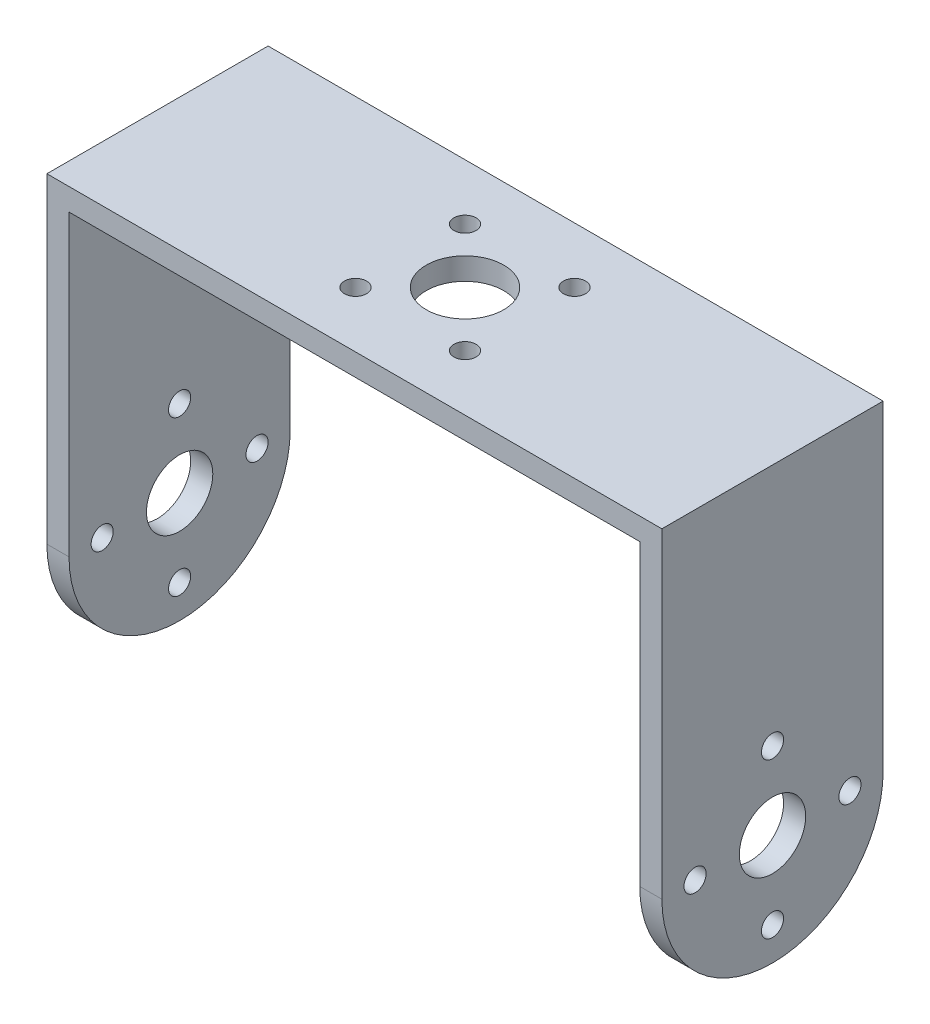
ISO-10303-21;
HEADER;
FILE_DESCRIPTION(('STEP AP214'),'2;1');
FILE_NAME('part.step','',(''),(''),'','','');
FILE_SCHEMA(('AUTOMOTIVE_DESIGN { 1 0 10303 214 1 1 1 1 }'));
ENDSEC;
DATA;
#1=APPLICATION_CONTEXT('core data for automotive mechanical design processes');
#2=APPLICATION_PROTOCOL_DEFINITION('international standard','automotive_design',2000,#1);
#3=PRODUCT_CONTEXT('',#1,'mechanical');
#4=PRODUCT('Part','Part','',(#3));
#5=PRODUCT_RELATED_PRODUCT_CATEGORY('part','',(#4));
#6=PRODUCT_DEFINITION_FORMATION('','',#4);
#7=PRODUCT_DEFINITION_CONTEXT('part definition',#1,'design');
#8=PRODUCT_DEFINITION('design','',#6,#7);
#9=PRODUCT_DEFINITION_SHAPE('','',#8);
#10=(LENGTH_UNIT() NAMED_UNIT(*) SI_UNIT(.MILLI.,.METRE.));
#11=(NAMED_UNIT(*) PLANE_ANGLE_UNIT() SI_UNIT($,.RADIAN.));
#12=(NAMED_UNIT(*) SI_UNIT($,.STERADIAN.) SOLID_ANGLE_UNIT());
#13=UNCERTAINTY_MEASURE_WITH_UNIT(LENGTH_MEASURE(1.E-05),#10,'distance_accuracy_value','');
#14=(GEOMETRIC_REPRESENTATION_CONTEXT(3) GLOBAL_UNCERTAINTY_ASSIGNED_CONTEXT((#13)) GLOBAL_UNIT_ASSIGNED_CONTEXT((#10,
#11,#12)) REPRESENTATION_CONTEXT('',''));
#15=CARTESIAN_POINT('',(0.,0.,0.));
#16=DIRECTION('',(0.,0.,1.));
#17=DIRECTION('',(1.,0.,0.));
#18=AXIS2_PLACEMENT_3D('',#15,#16,#17);
#19=CARTESIAN_POINT('',(27.8,20.5,20.));
#20=DIRECTION('',(-1.,0.,0.));
#21=DIRECTION('',(0.,-1.,0.));
#22=AXIS2_PLACEMENT_3D('',#19,#20,#21);
#23=PLANE('',#22);
#24=CARTESIAN_POINT('',(27.8,-8.5,3.));
#25=DIRECTION('',(1.,0.,0.));
#26=DIRECTION('',(0.,0.,-1.));
#27=AXIS2_PLACEMENT_3D('',#24,#25,#26);
#28=CIRCLE('',#27,1.);
#29=CARTESIAN_POINT('',(27.8,-8.5,2.));
#30=VERTEX_POINT('',#29);
#31=EDGE_CURVE('E212',#30,#30,#28,.T.);
#32=ORIENTED_EDGE('',*,*,#31,.F.);
#33=EDGE_LOOP('',(#32));
#34=FACE_BOUND('',#33,.T.);
#35=CARTESIAN_POINT('',(27.8,-8.5,10.));
#36=DIRECTION('',(1.,0.,0.));
#37=DIRECTION('',(0.,0.,-1.));
#38=AXIS2_PLACEMENT_3D('',#35,#36,#37);
#39=CIRCLE('',#38,3.);
#40=CARTESIAN_POINT('',(27.8,-8.5,7.));
#41=VERTEX_POINT('',#40);
#42=EDGE_CURVE('E202',#41,#41,#39,.T.);
#43=ORIENTED_EDGE('',*,*,#42,.F.);
#44=EDGE_LOOP('',(#43));
#45=FACE_BOUND('',#44,.T.);
#46=CARTESIAN_POINT('',(27.8,-15.5,10.));
#47=DIRECTION('',(1.,0.,0.));
#48=DIRECTION('',(0.,0.,-1.));
#49=AXIS2_PLACEMENT_3D('',#46,#47,#48);
#50=CIRCLE('',#49,1.);
#51=CARTESIAN_POINT('',(27.8,-15.5,9.));
#52=VERTEX_POINT('',#51);
#53=EDGE_CURVE('E199',#52,#52,#50,.T.);
#54=ORIENTED_EDGE('',*,*,#53,.F.);
#55=EDGE_LOOP('',(#54));
#56=FACE_BOUND('',#55,.T.);
#57=CARTESIAN_POINT('',(27.8,-8.5,17.));
#58=DIRECTION('',(1.,0.,0.));
#59=DIRECTION('',(0.,0.,-1.));
#60=AXIS2_PLACEMENT_3D('',#57,#58,#59);
#61=CIRCLE('',#60,1.);
#62=CARTESIAN_POINT('',(27.8,-8.5,16.));
#63=VERTEX_POINT('',#62);
#64=EDGE_CURVE('E196',#63,#63,#61,.T.);
#65=ORIENTED_EDGE('',*,*,#64,.F.);
#66=EDGE_LOOP('',(#65));
#67=FACE_BOUND('',#66,.T.);
#68=CARTESIAN_POINT('',(27.8,-1.5,10.));
#69=DIRECTION('',(1.,0.,0.));
#70=DIRECTION('',(0.,0.,-1.));
#71=AXIS2_PLACEMENT_3D('',#68,#69,#70);
#72=CIRCLE('',#71,1.);
#73=CARTESIAN_POINT('',(27.8,-1.5,9.));
#74=VERTEX_POINT('',#73);
#75=EDGE_CURVE('E192',#74,#74,#72,.T.);
#76=ORIENTED_EDGE('',*,*,#75,.F.);
#77=EDGE_LOOP('',(#76));
#78=FACE_BOUND('',#77,.T.);
#79=DIRECTION('',(0.,1.,0.));
#80=VECTOR('',#79,1.);
#81=CARTESIAN_POINT('',(27.8,20.5,20.));
#82=LINE('',#81,#80);
#83=CARTESIAN_POINT('',(27.8,-8.5,20.));
#84=VERTEX_POINT('',#83);
#85=CARTESIAN_POINT('',(27.8,20.5,20.));
#86=VERTEX_POINT('',#85);
#87=EDGE_CURVE('E110',#84,#86,#82,.T.);
#88=ORIENTED_EDGE('',*,*,#87,.F.);
#89=CARTESIAN_POINT('',(27.8,-8.5,10.));
#90=DIRECTION('',(-1.,0.,0.));
#91=DIRECTION('',(0.,-1.,0.));
#92=AXIS2_PLACEMENT_3D('',#89,#90,#91);
#93=CIRCLE('',#92,10.);
#94=CARTESIAN_POINT('',(27.8,-18.5,10.));
#95=VERTEX_POINT('',#94);
#96=EDGE_CURVE('E170',#84,#95,#93,.F.);
#97=ORIENTED_EDGE('',*,*,#96,.T.);
#98=CARTESIAN_POINT('',(27.8,-8.5,10.));
#99=DIRECTION('',(-1.,0.,0.));
#100=DIRECTION('',(0.,-1.,0.));
#101=AXIS2_PLACEMENT_3D('',#98,#99,#100);
#102=CIRCLE('',#101,10.);
#103=CARTESIAN_POINT('',(27.8,-8.5,0.));
#104=VERTEX_POINT('',#103);
#105=EDGE_CURVE('E168',#95,#104,#102,.F.);
#106=ORIENTED_EDGE('',*,*,#105,.T.);
#107=DIRECTION('',(0.,1.,0.));
#108=VECTOR('',#107,1.);
#109=CARTESIAN_POINT('',(27.8,20.5,0.));
#110=LINE('',#109,#108);
#111=CARTESIAN_POINT('',(27.8,20.5,0.));
#112=VERTEX_POINT('',#111);
#113=EDGE_CURVE('E126',#104,#112,#110,.T.);
#114=ORIENTED_EDGE('',*,*,#113,.T.);
#115=DIRECTION('',(0.,0.,-1.));
#116=VECTOR('',#115,1.);
#117=CARTESIAN_POINT('',(27.8,20.5,20.));
#118=LINE('',#117,#116);
#119=EDGE_CURVE('E124',#86,#112,#118,.T.);
#120=ORIENTED_EDGE('',*,*,#119,.F.);
#121=EDGE_LOOP('',(#88,#97,#106,#114,#120));
#122=FACE_BOUND('',#121,.T.);
#123=ADVANCED_FACE('F32',(#34,#45,#56,#67,#78,#122),#23,.F.);
#124=CARTESIAN_POINT('',(-27.8,20.5,20.));
#125=DIRECTION('',(0.,-1.,0.));
#126=DIRECTION('',(0.,0.,-1.));
#127=AXIS2_PLACEMENT_3D('',#124,#125,#126);
#128=PLANE('',#127);
#129=CARTESIAN_POINT('',(4.94974746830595,20.5,14.9497474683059));
#130=DIRECTION('',(0.,1.,0.));
#131=DIRECTION('',(0.,0.,1.));
#132=AXIS2_PLACEMENT_3D('',#129,#130,#131);
#133=CIRCLE('',#132,1.);
#134=CARTESIAN_POINT('',(4.94974746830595,20.5,15.9497474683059));
#135=VERTEX_POINT('',#134);
#136=EDGE_CURVE('E362',#135,#135,#133,.T.);
#137=ORIENTED_EDGE('',*,*,#136,.F.);
#138=EDGE_LOOP('',(#137));
#139=FACE_BOUND('',#138,.T.);
#140=CARTESIAN_POINT('',(-4.94974746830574,20.5,14.9497474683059));
#141=DIRECTION('',(0.,1.,0.));
#142=DIRECTION('',(0.,0.,1.));
#143=AXIS2_PLACEMENT_3D('',#140,#141,#142);
#144=CIRCLE('',#143,1.);
#145=CARTESIAN_POINT('',(-4.94974746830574,20.5,15.9497474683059));
#146=VERTEX_POINT('',#145);
#147=EDGE_CURVE('E356',#146,#146,#144,.T.);
#148=ORIENTED_EDGE('',*,*,#147,.F.);
#149=EDGE_LOOP('',(#148));
#150=FACE_BOUND('',#149,.T.);
#151=CARTESIAN_POINT('',(-4.94974746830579,20.5,5.05025253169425));
#152=DIRECTION('',(0.,1.,0.));
#153=DIRECTION('',(0.,0.,1.));
#154=AXIS2_PLACEMENT_3D('',#151,#152,#153);
#155=CIRCLE('',#154,1.);
#156=CARTESIAN_POINT('',(-4.94974746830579,20.5,6.05025253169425));
#157=VERTEX_POINT('',#156);
#158=EDGE_CURVE('E350',#157,#157,#155,.T.);
#159=ORIENTED_EDGE('',*,*,#158,.F.);
#160=EDGE_LOOP('',(#159));
#161=FACE_BOUND('',#160,.T.);
#162=CARTESIAN_POINT('',(4.94974746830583,20.5,5.05025253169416));
#163=DIRECTION('',(0.,1.,0.));
#164=DIRECTION('',(0.,0.,1.));
#165=AXIS2_PLACEMENT_3D('',#162,#163,#164);
#166=CIRCLE('',#165,1.);
#167=CARTESIAN_POINT('',(4.94974746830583,20.5,6.05025253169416));
#168=VERTEX_POINT('',#167);
#169=EDGE_CURVE('E344',#168,#168,#166,.T.);
#170=ORIENTED_EDGE('',*,*,#169,.F.);
#171=EDGE_LOOP('',(#170));
#172=FACE_BOUND('',#171,.T.);
#173=CARTESIAN_POINT('',(0.,20.5,10.));
#174=DIRECTION('',(0.,1.,0.));
#175=DIRECTION('',(0.,0.,1.));
#176=AXIS2_PLACEMENT_3D('',#173,#174,#175);
#177=CIRCLE('',#176,3.5);
#178=CARTESIAN_POINT('',(0.,20.5,13.5));
#179=VERTEX_POINT('',#178);
#180=EDGE_CURVE('E338',#179,#179,#177,.T.);
#181=ORIENTED_EDGE('',*,*,#180,.F.);
#182=EDGE_LOOP('',(#181));
#183=FACE_BOUND('',#182,.T.);
#184=DIRECTION('',(-1.,0.,0.));
#185=VECTOR('',#184,1.);
#186=CARTESIAN_POINT('',(-27.8,20.5,0.));
#187=LINE('',#186,#185);
#188=CARTESIAN_POINT('',(-27.8,20.5,0.));
#189=VERTEX_POINT('',#188);
#190=EDGE_CURVE('E148',#112,#189,#187,.T.);
#191=ORIENTED_EDGE('',*,*,#190,.T.);
#192=DIRECTION('',(0.,0.,-1.));
#193=VECTOR('',#192,1.);
#194=CARTESIAN_POINT('',(-27.8,20.5,20.));
#195=LINE('',#194,#193);
#196=CARTESIAN_POINT('',(-27.8,20.5,20.));
#197=VERTEX_POINT('',#196);
#198=EDGE_CURVE('E130',#197,#189,#195,.T.);
#199=ORIENTED_EDGE('',*,*,#198,.F.);
#200=DIRECTION('',(-1.,0.,0.));
#201=VECTOR('',#200,1.);
#202=CARTESIAN_POINT('',(-27.8,20.5,20.));
#203=LINE('',#202,#201);
#204=EDGE_CURVE('E116',#86,#197,#203,.T.);
#205=ORIENTED_EDGE('',*,*,#204,.F.);
#206=ORIENTED_EDGE('',*,*,#119,.T.);
#207=EDGE_LOOP('',(#191,#199,#205,#206));
#208=FACE_BOUND('',#207,.T.);
#209=ADVANCED_FACE('F132',(#139,#150,#161,#172,#183,#208),#128,.F.);
#210=CARTESIAN_POINT('',(-27.8,-18.5,20.));
#211=DIRECTION('',(1.,0.,0.));
#212=DIRECTION('',(0.,0.,-1.));
#213=AXIS2_PLACEMENT_3D('',#210,#211,#212);
#214=PLANE('',#213);
#215=CARTESIAN_POINT('',(-27.8,-8.5,3.));
#216=DIRECTION('',(1.,0.,0.));
#217=DIRECTION('',(0.,0.,-1.));
#218=AXIS2_PLACEMENT_3D('',#215,#216,#217);
#219=CIRCLE('',#218,1.);
#220=CARTESIAN_POINT('',(-27.8,-8.5,2.));
#221=VERTEX_POINT('',#220);
#222=EDGE_CURVE('E297',#221,#221,#219,.T.);
#223=ORIENTED_EDGE('',*,*,#222,.T.);
#224=EDGE_LOOP('',(#223));
#225=FACE_BOUND('',#224,.T.);
#226=CARTESIAN_POINT('',(-27.8,-8.5,10.));
#227=DIRECTION('',(1.,0.,0.));
#228=DIRECTION('',(0.,0.,-1.));
#229=AXIS2_PLACEMENT_3D('',#226,#227,#228);
#230=CIRCLE('',#229,3.);
#231=CARTESIAN_POINT('',(-27.8,-8.5,7.));
#232=VERTEX_POINT('',#231);
#233=EDGE_CURVE('E301',#232,#232,#230,.T.);
#234=ORIENTED_EDGE('',*,*,#233,.T.);
#235=EDGE_LOOP('',(#234));
#236=FACE_BOUND('',#235,.T.);
#237=CARTESIAN_POINT('',(-27.8,-15.5,10.));
#238=DIRECTION('',(1.,0.,0.));
#239=DIRECTION('',(0.,0.,-1.));
#240=AXIS2_PLACEMENT_3D('',#237,#238,#239);
#241=CIRCLE('',#240,1.);
#242=CARTESIAN_POINT('',(-27.8,-15.5,9.));
#243=VERTEX_POINT('',#242);
#244=EDGE_CURVE('E305',#243,#243,#241,.T.);
#245=ORIENTED_EDGE('',*,*,#244,.T.);
#246=EDGE_LOOP('',(#245));
#247=FACE_BOUND('',#246,.T.);
#248=CARTESIAN_POINT('',(-27.8,-8.5,17.));
#249=DIRECTION('',(1.,0.,0.));
#250=DIRECTION('',(0.,0.,-1.));
#251=AXIS2_PLACEMENT_3D('',#248,#249,#250);
#252=CIRCLE('',#251,1.);
#253=CARTESIAN_POINT('',(-27.8,-8.5,16.));
#254=VERTEX_POINT('',#253);
#255=EDGE_CURVE('E309',#254,#254,#252,.T.);
#256=ORIENTED_EDGE('',*,*,#255,.T.);
#257=EDGE_LOOP('',(#256));
#258=FACE_BOUND('',#257,.T.);
#259=CARTESIAN_POINT('',(-27.8,-1.5,10.));
#260=DIRECTION('',(1.,0.,0.));
#261=DIRECTION('',(0.,0.,-1.));
#262=AXIS2_PLACEMENT_3D('',#259,#260,#261);
#263=CIRCLE('',#262,1.);
#264=CARTESIAN_POINT('',(-27.8,-1.5,9.));
#265=VERTEX_POINT('',#264);
#266=EDGE_CURVE('E312',#265,#265,#263,.T.);
#267=ORIENTED_EDGE('',*,*,#266,.T.);
#268=EDGE_LOOP('',(#267));
#269=FACE_BOUND('',#268,.T.);
#270=CARTESIAN_POINT('',(-27.8,-8.5,10.));
#271=DIRECTION('',(1.,0.,0.));
#272=DIRECTION('',(0.,0.,-1.));
#273=AXIS2_PLACEMENT_3D('',#270,#271,#272);
#274=CIRCLE('',#273,10.);
#275=CARTESIAN_POINT('',(-27.8,-8.5,0.));
#276=VERTEX_POINT('',#275);
#277=CARTESIAN_POINT('',(-27.8,-18.5,10.));
#278=VERTEX_POINT('',#277);
#279=EDGE_CURVE('E41',#276,#278,#274,.F.);
#280=ORIENTED_EDGE('',*,*,#279,.T.);
#281=CARTESIAN_POINT('',(-27.8,-8.5,10.));
#282=DIRECTION('',(1.,0.,0.));
#283=DIRECTION('',(0.,0.,-1.));
#284=AXIS2_PLACEMENT_3D('',#281,#282,#283);
#285=CIRCLE('',#284,10.);
#286=CARTESIAN_POINT('',(-27.8,-8.5,20.));
#287=VERTEX_POINT('',#286);
#288=EDGE_CURVE('E11',#278,#287,#285,.F.);
#289=ORIENTED_EDGE('',*,*,#288,.T.);
#290=DIRECTION('',(0.,-1.,0.));
#291=VECTOR('',#290,1.);
#292=CARTESIAN_POINT('',(-27.8,-18.5,20.));
#293=LINE('',#292,#291);
#294=EDGE_CURVE('E135',#197,#287,#293,.T.);
#295=ORIENTED_EDGE('',*,*,#294,.F.);
#296=ORIENTED_EDGE('',*,*,#198,.T.);
#297=DIRECTION('',(0.,-1.,0.));
#298=VECTOR('',#297,1.);
#299=CARTESIAN_POINT('',(-27.8,-18.5,0.));
#300=LINE('',#299,#298);
#301=EDGE_CURVE('E151',#189,#276,#300,.T.);
#302=ORIENTED_EDGE('',*,*,#301,.T.);
#303=EDGE_LOOP('',(#280,#289,#295,#296,#302));
#304=FACE_BOUND('',#303,.T.);
#305=ADVANCED_FACE('F230',(#225,#236,#247,#258,#269,#304),#214,.F.);
#306=CARTESIAN_POINT('',(-25.8,18.5,20.));
#307=DIRECTION('',(-1.,0.,0.));
#308=DIRECTION('',(0.,-1.,0.));
#309=AXIS2_PLACEMENT_3D('',#306,#307,#308);
#310=PLANE('',#309);
#311=CARTESIAN_POINT('',(-25.8,-8.5,3.));
#312=DIRECTION('',(1.,0.,0.));
#313=DIRECTION('',(0.,0.,-1.));
#314=AXIS2_PLACEMENT_3D('',#311,#312,#313);
#315=CIRCLE('',#314,1.);
#316=CARTESIAN_POINT('',(-25.8,-8.5,2.));
#317=VERTEX_POINT('',#316);
#318=EDGE_CURVE('E332',#317,#317,#315,.T.);
#319=ORIENTED_EDGE('',*,*,#318,.F.);
#320=EDGE_LOOP('',(#319));
#321=FACE_BOUND('',#320,.T.);
#322=CARTESIAN_POINT('',(-25.8,-8.5,10.));
#323=DIRECTION('',(1.,0.,0.));
#324=DIRECTION('',(0.,0.,-1.));
#325=AXIS2_PLACEMENT_3D('',#322,#323,#324);
#326=CIRCLE('',#325,3.);
#327=CARTESIAN_POINT('',(-25.8,-8.5,7.));
#328=VERTEX_POINT('',#327);
#329=EDGE_CURVE('E328',#328,#328,#326,.T.);
#330=ORIENTED_EDGE('',*,*,#329,.F.);
#331=EDGE_LOOP('',(#330));
#332=FACE_BOUND('',#331,.T.);
#333=CARTESIAN_POINT('',(-25.8,-15.5,10.));
#334=DIRECTION('',(1.,0.,0.));
#335=DIRECTION('',(0.,0.,-1.));
#336=AXIS2_PLACEMENT_3D('',#333,#334,#335);
#337=CIRCLE('',#336,1.);
#338=CARTESIAN_POINT('',(-25.8,-15.5,9.));
#339=VERTEX_POINT('',#338);
#340=EDGE_CURVE('E324',#339,#339,#337,.T.);
#341=ORIENTED_EDGE('',*,*,#340,.F.);
#342=EDGE_LOOP('',(#341));
#343=FACE_BOUND('',#342,.T.);
#344=CARTESIAN_POINT('',(-25.8,-8.5,17.));
#345=DIRECTION('',(1.,0.,0.));
#346=DIRECTION('',(0.,0.,-1.));
#347=AXIS2_PLACEMENT_3D('',#344,#345,#346);
#348=CIRCLE('',#347,1.);
#349=CARTESIAN_POINT('',(-25.8,-8.5,16.));
#350=VERTEX_POINT('',#349);
#351=EDGE_CURVE('E320',#350,#350,#348,.T.);
#352=ORIENTED_EDGE('',*,*,#351,.F.);
#353=EDGE_LOOP('',(#352));
#354=FACE_BOUND('',#353,.T.);
#355=CARTESIAN_POINT('',(-25.8,-1.5,10.));
#356=DIRECTION('',(1.,0.,0.));
#357=DIRECTION('',(0.,0.,-1.));
#358=AXIS2_PLACEMENT_3D('',#355,#356,#357);
#359=CIRCLE('',#358,1.);
#360=CARTESIAN_POINT('',(-25.8,-1.5,9.));
#361=VERTEX_POINT('',#360);
#362=EDGE_CURVE('E314',#361,#361,#359,.T.);
#363=ORIENTED_EDGE('',*,*,#362,.F.);
#364=EDGE_LOOP('',(#363));
#365=FACE_BOUND('',#364,.T.);
#366=DIRECTION('',(0.,1.,0.));
#367=VECTOR('',#366,1.);
#368=CARTESIAN_POINT('',(-25.8,18.5,20.));
#369=LINE('',#368,#367);
#370=CARTESIAN_POINT('',(-25.8,-8.5,20.));
#371=VERTEX_POINT('',#370);
#372=CARTESIAN_POINT('',(-25.8,18.5,20.));
#373=VERTEX_POINT('',#372);
#374=EDGE_CURVE('E137',#371,#373,#369,.T.);
#375=ORIENTED_EDGE('',*,*,#374,.F.);
#376=CARTESIAN_POINT('',(-25.8,-8.5,10.));
#377=DIRECTION('',(-1.,0.,0.));
#378=DIRECTION('',(0.,-1.,0.));
#379=AXIS2_PLACEMENT_3D('',#376,#377,#378);
#380=CIRCLE('',#379,10.);
#381=CARTESIAN_POINT('',(-25.8,-18.5,10.));
#382=VERTEX_POINT('',#381);
#383=EDGE_CURVE('E55',#371,#382,#380,.F.);
#384=ORIENTED_EDGE('',*,*,#383,.T.);
#385=CARTESIAN_POINT('',(-25.8,-8.5,10.));
#386=DIRECTION('',(-1.,0.,0.));
#387=DIRECTION('',(0.,-1.,0.));
#388=AXIS2_PLACEMENT_3D('',#385,#386,#387);
#389=CIRCLE('',#388,10.);
#390=CARTESIAN_POINT('',(-25.8,-8.5,0.));
#391=VERTEX_POINT('',#390);
#392=EDGE_CURVE('E180',#382,#391,#389,.F.);
#393=ORIENTED_EDGE('',*,*,#392,.T.);
#394=DIRECTION('',(0.,1.,0.));
#395=VECTOR('',#394,1.);
#396=CARTESIAN_POINT('',(-25.8,18.5,0.));
#397=LINE('',#396,#395);
#398=CARTESIAN_POINT('',(-25.8,18.5,0.));
#399=VERTEX_POINT('',#398);
#400=EDGE_CURVE('E153',#391,#399,#397,.T.);
#401=ORIENTED_EDGE('',*,*,#400,.T.);
#402=DIRECTION('',(0.,0.,-1.));
#403=VECTOR('',#402,1.);
#404=CARTESIAN_POINT('',(-25.8,18.5,20.));
#405=LINE('',#404,#403);
#406=EDGE_CURVE('E161',#373,#399,#405,.T.);
#407=ORIENTED_EDGE('',*,*,#406,.F.);
#408=EDGE_LOOP('',(#375,#384,#393,#401,#407));
#409=FACE_BOUND('',#408,.T.);
#410=ADVANCED_FACE('F258',(#321,#332,#343,#354,#365,#409),#310,.F.);
#411=CARTESIAN_POINT('',(-25.8,18.5,20.));
#412=DIRECTION('',(0.,1.,0.));
#413=DIRECTION('',(0.,0.,1.));
#414=AXIS2_PLACEMENT_3D('',#411,#412,#413);
#415=PLANE('',#414);
#416=CARTESIAN_POINT('',(4.94974746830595,18.5,14.9497474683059));
#417=DIRECTION('',(0.,1.,0.));
#418=DIRECTION('',(0.,0.,1.));
#419=AXIS2_PLACEMENT_3D('',#416,#417,#418);
#420=CIRCLE('',#419,1.);
#421=CARTESIAN_POINT('',(4.94974746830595,18.5,15.9497474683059));
#422=VERTEX_POINT('',#421);
#423=EDGE_CURVE('E359',#422,#422,#420,.F.);
#424=ORIENTED_EDGE('',*,*,#423,.F.);
#425=EDGE_LOOP('',(#424));
#426=FACE_BOUND('',#425,.T.);
#427=CARTESIAN_POINT('',(-4.94974746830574,18.5,14.9497474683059));
#428=DIRECTION('',(0.,1.,0.));
#429=DIRECTION('',(0.,0.,1.));
#430=AXIS2_PLACEMENT_3D('',#427,#428,#429);
#431=CIRCLE('',#430,1.);
#432=CARTESIAN_POINT('',(-4.94974746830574,18.5,15.9497474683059));
#433=VERTEX_POINT('',#432);
#434=EDGE_CURVE('E353',#433,#433,#431,.F.);
#435=ORIENTED_EDGE('',*,*,#434,.F.);
#436=EDGE_LOOP('',(#435));
#437=FACE_BOUND('',#436,.T.);
#438=CARTESIAN_POINT('',(-4.94974746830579,18.5,5.05025253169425));
#439=DIRECTION('',(0.,1.,0.));
#440=DIRECTION('',(0.,0.,1.));
#441=AXIS2_PLACEMENT_3D('',#438,#439,#440);
#442=CIRCLE('',#441,1.);
#443=CARTESIAN_POINT('',(-4.94974746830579,18.5,6.05025253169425));
#444=VERTEX_POINT('',#443);
#445=EDGE_CURVE('E347',#444,#444,#442,.F.);
#446=ORIENTED_EDGE('',*,*,#445,.F.);
#447=EDGE_LOOP('',(#446));
#448=FACE_BOUND('',#447,.T.);
#449=CARTESIAN_POINT('',(4.94974746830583,18.5,5.05025253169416));
#450=DIRECTION('',(0.,1.,0.));
#451=DIRECTION('',(0.,0.,1.));
#452=AXIS2_PLACEMENT_3D('',#449,#450,#451);
#453=CIRCLE('',#452,1.);
#454=CARTESIAN_POINT('',(4.94974746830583,18.5,6.05025253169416));
#455=VERTEX_POINT('',#454);
#456=EDGE_CURVE('E341',#455,#455,#453,.F.);
#457=ORIENTED_EDGE('',*,*,#456,.F.);
#458=EDGE_LOOP('',(#457));
#459=FACE_BOUND('',#458,.T.);
#460=CARTESIAN_POINT('',(0.,18.5,10.));
#461=DIRECTION('',(0.,1.,0.));
#462=DIRECTION('',(0.,0.,1.));
#463=AXIS2_PLACEMENT_3D('',#460,#461,#462);
#464=CIRCLE('',#463,3.5);
#465=CARTESIAN_POINT('',(0.,18.5,13.5));
#466=VERTEX_POINT('',#465);
#467=EDGE_CURVE('E335',#466,#466,#464,.F.);
#468=ORIENTED_EDGE('',*,*,#467,.F.);
#469=EDGE_LOOP('',(#468));
#470=FACE_BOUND('',#469,.T.);
#471=DIRECTION('',(1.,0.,0.));
#472=VECTOR('',#471,1.);
#473=CARTESIAN_POINT('',(-25.8,18.5,0.));
#474=LINE('',#473,#472);
#475=CARTESIAN_POINT('',(25.8,18.5,0.));
#476=VERTEX_POINT('',#475);
#477=EDGE_CURVE('E155',#399,#476,#474,.T.);
#478=ORIENTED_EDGE('',*,*,#477,.T.);
#479=DIRECTION('',(0.,0.,-1.));
#480=VECTOR('',#479,1.);
#481=CARTESIAN_POINT('',(25.8,18.5,20.));
#482=LINE('',#481,#480);
#483=CARTESIAN_POINT('',(25.8,18.5,20.));
#484=VERTEX_POINT('',#483);
#485=EDGE_CURVE('E146',#484,#476,#482,.T.);
#486=ORIENTED_EDGE('',*,*,#485,.F.);
#487=DIRECTION('',(1.,0.,0.));
#488=VECTOR('',#487,1.);
#489=CARTESIAN_POINT('',(-25.8,18.5,20.));
#490=LINE('',#489,#488);
#491=EDGE_CURVE('E142',#373,#484,#490,.T.);
#492=ORIENTED_EDGE('',*,*,#491,.F.);
#493=ORIENTED_EDGE('',*,*,#406,.T.);
#494=EDGE_LOOP('',(#478,#486,#492,#493));
#495=FACE_BOUND('',#494,.T.);
#496=ADVANCED_FACE('F264',(#426,#437,#448,#459,#470,#495),#415,.F.);
#497=CARTESIAN_POINT('',(25.8,18.5,20.));
#498=DIRECTION('',(1.,0.,0.));
#499=DIRECTION('',(0.,1.,0.));
#500=AXIS2_PLACEMENT_3D('',#497,#498,#499);
#501=PLANE('',#500);
#502=CARTESIAN_POINT('',(25.8,-8.5,3.));
#503=DIRECTION('',(1.,0.,0.));
#504=DIRECTION('',(0.,1.,0.));
#505=AXIS2_PLACEMENT_3D('',#502,#503,#504);
#506=CIRCLE('',#505,1.);
#507=CARTESIAN_POINT('',(25.8,-7.5,3.));
#508=VERTEX_POINT('',#507);
#509=EDGE_CURVE('E36',#508,#508,#506,.T.);
#510=ORIENTED_EDGE('',*,*,#509,.T.);
#511=EDGE_LOOP('',(#510));
#512=FACE_BOUND('',#511,.T.);
#513=CARTESIAN_POINT('',(25.8,-8.5,10.));
#514=DIRECTION('',(1.,0.,0.));
#515=DIRECTION('',(0.,1.,0.));
#516=AXIS2_PLACEMENT_3D('',#513,#514,#515);
#517=CIRCLE('',#516,3.);
#518=CARTESIAN_POINT('',(25.8,-5.5,10.));
#519=VERTEX_POINT('',#518);
#520=EDGE_CURVE('E200',#519,#519,#517,.T.);
#521=ORIENTED_EDGE('',*,*,#520,.T.);
#522=EDGE_LOOP('',(#521));
#523=FACE_BOUND('',#522,.T.);
#524=CARTESIAN_POINT('',(25.8,-15.5,10.));
#525=DIRECTION('',(1.,0.,0.));
#526=DIRECTION('',(0.,1.,0.));
#527=AXIS2_PLACEMENT_3D('',#524,#525,#526);
#528=CIRCLE('',#527,1.);
#529=CARTESIAN_POINT('',(25.8,-14.5,10.));
#530=VERTEX_POINT('',#529);
#531=EDGE_CURVE('E197',#530,#530,#528,.T.);
#532=ORIENTED_EDGE('',*,*,#531,.T.);
#533=EDGE_LOOP('',(#532));
#534=FACE_BOUND('',#533,.T.);
#535=CARTESIAN_POINT('',(25.8,-8.5,17.));
#536=DIRECTION('',(1.,0.,0.));
#537=DIRECTION('',(0.,1.,0.));
#538=AXIS2_PLACEMENT_3D('',#535,#536,#537);
#539=CIRCLE('',#538,1.);
#540=CARTESIAN_POINT('',(25.8,-7.5,17.));
#541=VERTEX_POINT('',#540);
#542=EDGE_CURVE('E193',#541,#541,#539,.T.);
#543=ORIENTED_EDGE('',*,*,#542,.T.);
#544=EDGE_LOOP('',(#543));
#545=FACE_BOUND('',#544,.T.);
#546=CARTESIAN_POINT('',(25.8,-1.5,10.));
#547=DIRECTION('',(1.,0.,0.));
#548=DIRECTION('',(0.,1.,0.));
#549=AXIS2_PLACEMENT_3D('',#546,#547,#548);
#550=CIRCLE('',#549,1.);
#551=CARTESIAN_POINT('',(25.8,-0.500000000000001,10.));
#552=VERTEX_POINT('',#551);
#553=EDGE_CURVE('E189',#552,#552,#550,.T.);
#554=ORIENTED_EDGE('',*,*,#553,.T.);
#555=EDGE_LOOP('',(#554));
#556=FACE_BOUND('',#555,.T.);
#557=CARTESIAN_POINT('',(25.8,-8.5,10.));
#558=DIRECTION('',(1.,0.,0.));
#559=DIRECTION('',(0.,1.,0.));
#560=AXIS2_PLACEMENT_3D('',#557,#558,#559);
#561=CIRCLE('',#560,10.);
#562=CARTESIAN_POINT('',(25.8,-8.5,0.));
#563=VERTEX_POINT('',#562);
#564=CARTESIAN_POINT('',(25.8,-18.5,10.));
#565=VERTEX_POINT('',#564);
#566=EDGE_CURVE('E172',#563,#565,#561,.F.);
#567=ORIENTED_EDGE('',*,*,#566,.T.);
#568=CARTESIAN_POINT('',(25.8,-8.5,10.));
#569=DIRECTION('',(1.,0.,0.));
#570=DIRECTION('',(0.,1.,0.));
#571=AXIS2_PLACEMENT_3D('',#568,#569,#570);
#572=CIRCLE('',#571,10.);
#573=CARTESIAN_POINT('',(25.8,-8.5,20.));
#574=VERTEX_POINT('',#573);
#575=EDGE_CURVE('E174',#565,#574,#572,.F.);
#576=ORIENTED_EDGE('',*,*,#575,.T.);
#577=DIRECTION('',(0.,-1.,0.));
#578=VECTOR('',#577,1.);
#579=CARTESIAN_POINT('',(25.8,18.5,20.));
#580=LINE('',#579,#578);
#581=EDGE_CURVE('E144',#484,#574,#580,.T.);
#582=ORIENTED_EDGE('',*,*,#581,.F.);
#583=ORIENTED_EDGE('',*,*,#485,.T.);
#584=DIRECTION('',(0.,-1.,0.));
#585=VECTOR('',#584,1.);
#586=CARTESIAN_POINT('',(25.8,18.5,0.));
#587=LINE('',#586,#585);
#588=EDGE_CURVE('E121',#476,#563,#587,.T.);
#589=ORIENTED_EDGE('',*,*,#588,.T.);
#590=EDGE_LOOP('',(#567,#576,#582,#583,#589));
#591=FACE_BOUND('',#590,.T.);
#592=ADVANCED_FACE('F274',(#512,#523,#534,#545,#556,#591),#501,.F.);
#593=CARTESIAN_POINT('',(0.,0.,20.));
#594=DIRECTION('',(0.,0.,1.));
#595=DIRECTION('',(1.,0.,0.));
#596=AXIS2_PLACEMENT_3D('',#593,#594,#595);
#597=PLANE('',#596);
#598=ORIENTED_EDGE('',*,*,#581,.T.);
#599=DIRECTION('',(1.,0.,0.));
#600=VECTOR('',#599,1.);
#601=CARTESIAN_POINT('',(27.8,-8.5,20.));
#602=LINE('',#601,#600);
#603=EDGE_CURVE('E119',#574,#84,#602,.T.);
#604=ORIENTED_EDGE('',*,*,#603,.T.);
#605=ORIENTED_EDGE('',*,*,#87,.T.);
#606=ORIENTED_EDGE('',*,*,#204,.T.);
#607=ORIENTED_EDGE('',*,*,#294,.T.);
#608=DIRECTION('',(1.,0.,0.));
#609=VECTOR('',#608,1.);
#610=CARTESIAN_POINT('',(-25.8,-8.5,20.));
#611=LINE('',#610,#609);
#612=EDGE_CURVE('E129',#287,#371,#611,.T.);
#613=ORIENTED_EDGE('',*,*,#612,.T.);
#614=ORIENTED_EDGE('',*,*,#374,.T.);
#615=ORIENTED_EDGE('',*,*,#491,.T.);
#616=EDGE_LOOP('',(#598,#604,#605,#606,#607,#613,#614,#615));
#617=FACE_BOUND('',#616,.T.);
#618=ADVANCED_FACE('F113',(#617),#597,.T.);
#619=CARTESIAN_POINT('',(0.,0.,0.));
#620=DIRECTION('',(0.,0.,1.));
#621=DIRECTION('',(1.,0.,0.));
#622=AXIS2_PLACEMENT_3D('',#619,#620,#621);
#623=PLANE('',#622);
#624=ORIENTED_EDGE('',*,*,#113,.F.);
#625=DIRECTION('',(1.,0.,0.));
#626=VECTOR('',#625,1.);
#627=CARTESIAN_POINT('',(0.,-8.49999999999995,0.));
#628=LINE('',#627,#626);
#629=EDGE_CURVE('E178',#104,#563,#628,.F.);
#630=ORIENTED_EDGE('',*,*,#629,.T.);
#631=ORIENTED_EDGE('',*,*,#588,.F.);
#632=ORIENTED_EDGE('',*,*,#477,.F.);
#633=ORIENTED_EDGE('',*,*,#400,.F.);
#634=DIRECTION('',(1.,0.,0.));
#635=VECTOR('',#634,1.);
#636=CARTESIAN_POINT('',(0.,-8.5,0.));
#637=LINE('',#636,#635);
#638=EDGE_CURVE('E176',#391,#276,#637,.F.);
#639=ORIENTED_EDGE('',*,*,#638,.T.);
#640=ORIENTED_EDGE('',*,*,#301,.F.);
#641=ORIENTED_EDGE('',*,*,#190,.F.);
#642=EDGE_LOOP('',(#624,#630,#631,#632,#633,#639,#640,#641));
#643=FACE_BOUND('',#642,.T.);
#644=ADVANCED_FACE('F243',(#643),#623,.F.);
#645=CARTESIAN_POINT('',(27.8,-8.5,10.));
#646=DIRECTION('',(1.,0.,0.));
#647=DIRECTION('',(0.,1.,0.));
#648=AXIS2_PLACEMENT_3D('',#645,#646,#647);
#649=CYLINDRICAL_SURFACE('',#648,10.);
#650=DIRECTION('',(1.,0.,0.));
#651=VECTOR('',#650,1.);
#652=CARTESIAN_POINT('',(27.8,-18.5,10.));
#653=LINE('',#652,#651);
#654=EDGE_CURVE('E149',#565,#95,#653,.T.);
#655=ORIENTED_EDGE('',*,*,#654,.F.);
#656=ORIENTED_EDGE('',*,*,#566,.F.);
#657=ORIENTED_EDGE('',*,*,#629,.F.);
#658=ORIENTED_EDGE('',*,*,#105,.F.);
#659=EDGE_LOOP('',(#655,#656,#657,#658));
#660=FACE_BOUND('',#659,.T.);
#661=ADVANCED_FACE('F240',(#660),#649,.T.);
#662=CARTESIAN_POINT('',(0.,-8.49999999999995,10.));
#663=DIRECTION('',(-1.,0.,0.));
#664=DIRECTION('',(0.,-1.,0.));
#665=AXIS2_PLACEMENT_3D('',#662,#663,#664);
#666=CYLINDRICAL_SURFACE('',#665,10.);
#667=ORIENTED_EDGE('',*,*,#575,.F.);
#668=ORIENTED_EDGE('',*,*,#654,.T.);
#669=ORIENTED_EDGE('',*,*,#96,.F.);
#670=ORIENTED_EDGE('',*,*,#603,.F.);
#671=EDGE_LOOP('',(#667,#668,#669,#670));
#672=FACE_BOUND('',#671,.T.);
#673=ADVANCED_FACE('F237',(#672),#666,.T.);
#674=CARTESIAN_POINT('',(-25.8,-8.5,10.));
#675=DIRECTION('',(1.,0.,0.));
#676=DIRECTION('',(0.,0.,-1.));
#677=AXIS2_PLACEMENT_3D('',#674,#675,#676);
#678=CYLINDRICAL_SURFACE('',#677,10.);
#679=DIRECTION('',(1.,0.,0.));
#680=VECTOR('',#679,1.);
#681=CARTESIAN_POINT('',(-25.8,-18.5,10.));
#682=LINE('',#681,#680);
#683=EDGE_CURVE('E186',#278,#382,#682,.T.);
#684=ORIENTED_EDGE('',*,*,#683,.F.);
#685=ORIENTED_EDGE('',*,*,#279,.F.);
#686=ORIENTED_EDGE('',*,*,#638,.F.);
#687=ORIENTED_EDGE('',*,*,#392,.F.);
#688=EDGE_LOOP('',(#684,#685,#686,#687));
#689=FACE_BOUND('',#688,.T.);
#690=ADVANCED_FACE('F34',(#689),#678,.T.);
#691=CARTESIAN_POINT('',(0.,-8.5,10.));
#692=DIRECTION('',(-1.,0.,0.));
#693=DIRECTION('',(0.,0.,1.));
#694=AXIS2_PLACEMENT_3D('',#691,#692,#693);
#695=CYLINDRICAL_SURFACE('',#694,10.);
#696=ORIENTED_EDGE('',*,*,#288,.F.);
#697=ORIENTED_EDGE('',*,*,#683,.T.);
#698=ORIENTED_EDGE('',*,*,#383,.F.);
#699=ORIENTED_EDGE('',*,*,#612,.F.);
#700=EDGE_LOOP('',(#696,#697,#698,#699));
#701=FACE_BOUND('',#700,.T.);
#702=ADVANCED_FACE('F245',(#701),#695,.T.);
#703=CARTESIAN_POINT('',(24.3,-1.5,10.));
#704=DIRECTION('',(1.,0.,0.));
#705=DIRECTION('',(0.,0.,-1.));
#706=AXIS2_PLACEMENT_3D('',#703,#704,#705);
#707=CYLINDRICAL_SURFACE('',#706,1.);
#708=ORIENTED_EDGE('',*,*,#75,.T.);
#709=EDGE_LOOP('',(#708));
#710=FACE_BOUND('',#709,.T.);
#711=ORIENTED_EDGE('',*,*,#553,.F.);
#712=EDGE_LOOP('',(#711));
#713=FACE_BOUND('',#712,.T.);
#714=ADVANCED_FACE('F220',(#710,#713),#707,.F.);
#715=CARTESIAN_POINT('',(24.3,-8.5,17.));
#716=DIRECTION('',(1.,0.,0.));
#717=DIRECTION('',(0.,0.,-1.));
#718=AXIS2_PLACEMENT_3D('',#715,#716,#717);
#719=CYLINDRICAL_SURFACE('',#718,1.);
#720=ORIENTED_EDGE('',*,*,#64,.T.);
#721=EDGE_LOOP('',(#720));
#722=FACE_BOUND('',#721,.T.);
#723=ORIENTED_EDGE('',*,*,#542,.F.);
#724=EDGE_LOOP('',(#723));
#725=FACE_BOUND('',#724,.T.);
#726=ADVANCED_FACE('F252',(#722,#725),#719,.F.);
#727=CARTESIAN_POINT('',(24.3,-15.5,10.));
#728=DIRECTION('',(1.,0.,0.));
#729=DIRECTION('',(0.,0.,-1.));
#730=AXIS2_PLACEMENT_3D('',#727,#728,#729);
#731=CYLINDRICAL_SURFACE('',#730,1.);
#732=ORIENTED_EDGE('',*,*,#53,.T.);
#733=EDGE_LOOP('',(#732));
#734=FACE_BOUND('',#733,.T.);
#735=ORIENTED_EDGE('',*,*,#531,.F.);
#736=EDGE_LOOP('',(#735));
#737=FACE_BOUND('',#736,.T.);
#738=ADVANCED_FACE('F419',(#734,#737),#731,.F.);
#739=CARTESIAN_POINT('',(24.3,-8.5,10.));
#740=DIRECTION('',(1.,0.,0.));
#741=DIRECTION('',(0.,0.,-1.));
#742=AXIS2_PLACEMENT_3D('',#739,#740,#741);
#743=CYLINDRICAL_SURFACE('',#742,3.);
#744=ORIENTED_EDGE('',*,*,#42,.T.);
#745=EDGE_LOOP('',(#744));
#746=FACE_BOUND('',#745,.T.);
#747=ORIENTED_EDGE('',*,*,#520,.F.);
#748=EDGE_LOOP('',(#747));
#749=FACE_BOUND('',#748,.T.);
#750=ADVANCED_FACE('F415',(#746,#749),#743,.F.);
#751=CARTESIAN_POINT('',(24.3,-8.5,3.));
#752=DIRECTION('',(1.,0.,0.));
#753=DIRECTION('',(0.,0.,-1.));
#754=AXIS2_PLACEMENT_3D('',#751,#752,#753);
#755=CYLINDRICAL_SURFACE('',#754,1.);
#756=ORIENTED_EDGE('',*,*,#31,.T.);
#757=EDGE_LOOP('',(#756));
#758=FACE_BOUND('',#757,.T.);
#759=ORIENTED_EDGE('',*,*,#509,.F.);
#760=EDGE_LOOP('',(#759));
#761=FACE_BOUND('',#760,.T.);
#762=ADVANCED_FACE('F411',(#758,#761),#755,.F.);
#763=CARTESIAN_POINT('',(-29.3,-1.5,10.));
#764=DIRECTION('',(1.,0.,0.));
#765=DIRECTION('',(0.,0.,-1.));
#766=AXIS2_PLACEMENT_3D('',#763,#764,#765);
#767=CYLINDRICAL_SURFACE('',#766,1.);
#768=ORIENTED_EDGE('',*,*,#362,.T.);
#769=EDGE_LOOP('',(#768));
#770=FACE_BOUND('',#769,.T.);
#771=ORIENTED_EDGE('',*,*,#266,.F.);
#772=EDGE_LOOP('',(#771));
#773=FACE_BOUND('',#772,.T.);
#774=ADVANCED_FACE('F407',(#770,#773),#767,.F.);
#775=CARTESIAN_POINT('',(-29.3,-8.5,17.));
#776=DIRECTION('',(1.,0.,0.));
#777=DIRECTION('',(0.,0.,-1.));
#778=AXIS2_PLACEMENT_3D('',#775,#776,#777);
#779=CYLINDRICAL_SURFACE('',#778,1.);
#780=ORIENTED_EDGE('',*,*,#351,.T.);
#781=EDGE_LOOP('',(#780));
#782=FACE_BOUND('',#781,.T.);
#783=ORIENTED_EDGE('',*,*,#255,.F.);
#784=EDGE_LOOP('',(#783));
#785=FACE_BOUND('',#784,.T.);
#786=ADVANCED_FACE('F403',(#782,#785),#779,.F.);
#787=CARTESIAN_POINT('',(-29.3,-15.5,10.));
#788=DIRECTION('',(1.,0.,0.));
#789=DIRECTION('',(0.,0.,-1.));
#790=AXIS2_PLACEMENT_3D('',#787,#788,#789);
#791=CYLINDRICAL_SURFACE('',#790,1.);
#792=ORIENTED_EDGE('',*,*,#340,.T.);
#793=EDGE_LOOP('',(#792));
#794=FACE_BOUND('',#793,.T.);
#795=ORIENTED_EDGE('',*,*,#244,.F.);
#796=EDGE_LOOP('',(#795));
#797=FACE_BOUND('',#796,.T.);
#798=ADVANCED_FACE('F399',(#794,#797),#791,.F.);
#799=CARTESIAN_POINT('',(-29.3,-8.5,10.));
#800=DIRECTION('',(1.,0.,0.));
#801=DIRECTION('',(0.,0.,-1.));
#802=AXIS2_PLACEMENT_3D('',#799,#800,#801);
#803=CYLINDRICAL_SURFACE('',#802,3.);
#804=ORIENTED_EDGE('',*,*,#329,.T.);
#805=EDGE_LOOP('',(#804));
#806=FACE_BOUND('',#805,.T.);
#807=ORIENTED_EDGE('',*,*,#233,.F.);
#808=EDGE_LOOP('',(#807));
#809=FACE_BOUND('',#808,.T.);
#810=ADVANCED_FACE('F392',(#806,#809),#803,.F.);
#811=CARTESIAN_POINT('',(-29.3,-8.5,3.));
#812=DIRECTION('',(1.,0.,0.));
#813=DIRECTION('',(0.,0.,-1.));
#814=AXIS2_PLACEMENT_3D('',#811,#812,#813);
#815=CYLINDRICAL_SURFACE('',#814,1.);
#816=ORIENTED_EDGE('',*,*,#318,.T.);
#817=EDGE_LOOP('',(#816));
#818=FACE_BOUND('',#817,.T.);
#819=ORIENTED_EDGE('',*,*,#222,.F.);
#820=EDGE_LOOP('',(#819));
#821=FACE_BOUND('',#820,.T.);
#822=ADVANCED_FACE('F381',(#818,#821),#815,.F.);
#823=CARTESIAN_POINT('',(0.,-18.501,10.));
#824=DIRECTION('',(0.,1.,0.));
#825=DIRECTION('',(0.,0.,1.));
#826=AXIS2_PLACEMENT_3D('',#823,#824,#825);
#827=CYLINDRICAL_SURFACE('',#826,3.5);
#828=ORIENTED_EDGE('',*,*,#180,.T.);
#829=EDGE_LOOP('',(#828));
#830=FACE_BOUND('',#829,.T.);
#831=ORIENTED_EDGE('',*,*,#467,.T.);
#832=EDGE_LOOP('',(#831));
#833=FACE_BOUND('',#832,.T.);
#834=ADVANCED_FACE('F377',(#830,#833),#827,.F.);
#835=CARTESIAN_POINT('',(4.94974746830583,-18.501,5.05025253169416));
#836=DIRECTION('',(0.,1.,0.));
#837=DIRECTION('',(0.,0.,1.));
#838=AXIS2_PLACEMENT_3D('',#835,#836,#837);
#839=CYLINDRICAL_SURFACE('',#838,1.);
#840=ORIENTED_EDGE('',*,*,#169,.T.);
#841=EDGE_LOOP('',(#840));
#842=FACE_BOUND('',#841,.T.);
#843=ORIENTED_EDGE('',*,*,#456,.T.);
#844=EDGE_LOOP('',(#843));
#845=FACE_BOUND('',#844,.T.);
#846=ADVANCED_FACE('F380',(#842,#845),#839,.F.);
#847=CARTESIAN_POINT('',(-4.94974746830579,-18.501,5.05025253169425));
#848=DIRECTION('',(0.,1.,0.));
#849=DIRECTION('',(0.,0.,1.));
#850=AXIS2_PLACEMENT_3D('',#847,#848,#849);
#851=CYLINDRICAL_SURFACE('',#850,1.);
#852=ORIENTED_EDGE('',*,*,#158,.T.);
#853=EDGE_LOOP('',(#852));
#854=FACE_BOUND('',#853,.T.);
#855=ORIENTED_EDGE('',*,*,#445,.T.);
#856=EDGE_LOOP('',(#855));
#857=FACE_BOUND('',#856,.T.);
#858=ADVANCED_FACE('F389',(#854,#857),#851,.F.);
#859=CARTESIAN_POINT('',(-4.94974746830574,-18.501,14.9497474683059));
#860=DIRECTION('',(0.,1.,0.));
#861=DIRECTION('',(0.,0.,1.));
#862=AXIS2_PLACEMENT_3D('',#859,#860,#861);
#863=CYLINDRICAL_SURFACE('',#862,1.);
#864=ORIENTED_EDGE('',*,*,#147,.T.);
#865=EDGE_LOOP('',(#864));
#866=FACE_BOUND('',#865,.T.);
#867=ORIENTED_EDGE('',*,*,#434,.T.);
#868=EDGE_LOOP('',(#867));
#869=FACE_BOUND('',#868,.T.);
#870=ADVANCED_FACE('F494',(#866,#869),#863,.F.);
#871=CARTESIAN_POINT('',(4.94974746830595,-18.501,14.9497474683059));
#872=DIRECTION('',(0.,1.,0.));
#873=DIRECTION('',(0.,0.,1.));
#874=AXIS2_PLACEMENT_3D('',#871,#872,#873);
#875=CYLINDRICAL_SURFACE('',#874,1.);
#876=ORIENTED_EDGE('',*,*,#136,.T.);
#877=EDGE_LOOP('',(#876));
#878=FACE_BOUND('',#877,.T.);
#879=ORIENTED_EDGE('',*,*,#423,.T.);
#880=EDGE_LOOP('',(#879));
#881=FACE_BOUND('',#880,.T.);
#882=ADVANCED_FACE('F366',(#878,#881),#875,.F.);
#883=CLOSED_SHELL('',(#123,#209,#305,#410,#496,#592,#618,#644,#661,#673,#690,#702,#714,#726,
#738,#750,#762,#774,#786,#798,#810,#822,#834,#846,#858,#870,#882));
#884=MANIFOLD_SOLID_BREP('B2',#883);
#885=ADVANCED_BREP_SHAPE_REPRESENTATION('',(#18,#884),#14);
#886=SHAPE_DEFINITION_REPRESENTATION(#9,#885);
ENDSEC;
END-ISO-10303-21;
